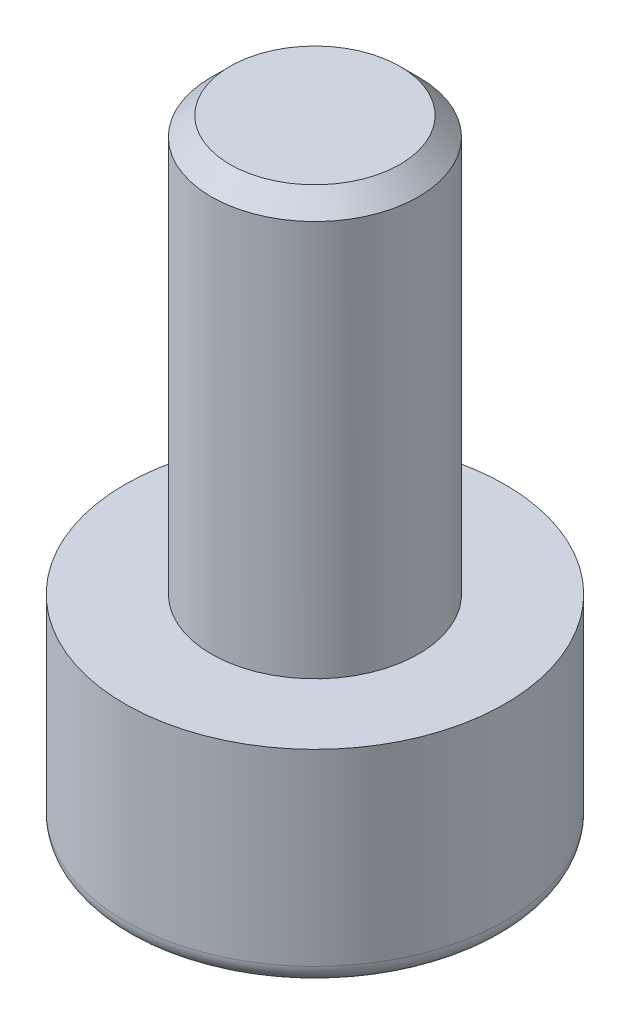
ISO-10303-21;
HEADER;
FILE_DESCRIPTION(('STEP AP214'),'2;1');
FILE_NAME('part.step','',(''),(''),'','','');
FILE_SCHEMA(('AUTOMOTIVE_DESIGN { 1 0 10303 214 1 1 1 1 }'));
ENDSEC;
DATA;
#1=APPLICATION_CONTEXT('core data for automotive mechanical design processes');
#2=APPLICATION_PROTOCOL_DEFINITION('international standard','automotive_design',2000,#1);
#3=PRODUCT_CONTEXT('',#1,'mechanical');
#4=PRODUCT('Part','Part','',(#3));
#5=PRODUCT_RELATED_PRODUCT_CATEGORY('part','',(#4));
#6=PRODUCT_DEFINITION_FORMATION('','',#4);
#7=PRODUCT_DEFINITION_CONTEXT('part definition',#1,'design');
#8=PRODUCT_DEFINITION('design','',#6,#7);
#9=PRODUCT_DEFINITION_SHAPE('','',#8);
#10=(LENGTH_UNIT() NAMED_UNIT(*) SI_UNIT(.MILLI.,.METRE.));
#11=(NAMED_UNIT(*) PLANE_ANGLE_UNIT() SI_UNIT($,.RADIAN.));
#12=(NAMED_UNIT(*) SI_UNIT($,.STERADIAN.) SOLID_ANGLE_UNIT());
#13=UNCERTAINTY_MEASURE_WITH_UNIT(LENGTH_MEASURE(1.E-05),#10,'distance_accuracy_value','');
#14=(GEOMETRIC_REPRESENTATION_CONTEXT(3) GLOBAL_UNCERTAINTY_ASSIGNED_CONTEXT((#13)) GLOBAL_UNIT_ASSIGNED_CONTEXT((#10,
#11,#12)) REPRESENTATION_CONTEXT('',''));
#15=CARTESIAN_POINT('',(0.,0.,0.));
#16=DIRECTION('',(0.,0.,1.));
#17=DIRECTION('',(1.,0.,0.));
#18=AXIS2_PLACEMENT_3D('',#15,#16,#17);
#19=CARTESIAN_POINT('',(0.,0.,0.));
#20=DIRECTION('',(0.,1.,0.));
#21=DIRECTION('',(-1.,0.,0.));
#22=AXIS2_PLACEMENT_3D('',#19,#20,#21);
#23=PLANE('',#22);
#24=CARTESIAN_POINT('',(0.,0.,0.));
#25=DIRECTION('',(0.,1.,0.));
#26=DIRECTION('',(-1.,0.,0.));
#27=AXIS2_PLACEMENT_3D('',#24,#25,#26);
#28=CIRCLE('',#27,2.47);
#29=CARTESIAN_POINT('',(-2.47,0.,0.));
#30=VERTEX_POINT('',#29);
#31=EDGE_CURVE('E150',#30,#30,#28,.F.);
#32=ORIENTED_EDGE('',*,*,#31,.T.);
#33=EDGE_LOOP('',(#32));
#34=FACE_BOUND('',#33,.T.);
#35=DIRECTION('',(-1.,0.,0.));
#36=VECTOR('',#35,1.);
#37=CARTESIAN_POINT('',(0.834271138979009,0.,1.445));
#38=LINE('',#37,#36);
#39=CARTESIAN_POINT('',(0.834271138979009,0.,1.445));
#40=VERTEX_POINT('',#39);
#41=CARTESIAN_POINT('',(-0.834271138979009,0.,1.445));
#42=VERTEX_POINT('',#41);
#43=EDGE_CURVE('E123',#40,#42,#38,.T.);
#44=ORIENTED_EDGE('',*,*,#43,.F.);
#45=DIRECTION('',(-0.5,0.,0.866025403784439));
#46=VECTOR('',#45,1.);
#47=CARTESIAN_POINT('',(1.66854227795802,0.,0.));
#48=LINE('',#47,#46);
#49=CARTESIAN_POINT('',(1.66854227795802,0.,0.));
#50=VERTEX_POINT('',#49);
#51=EDGE_CURVE('E49',#50,#40,#48,.T.);
#52=ORIENTED_EDGE('',*,*,#51,.F.);
#53=DIRECTION('',(0.5,0.,0.866025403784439));
#54=VECTOR('',#53,1.);
#55=CARTESIAN_POINT('',(0.83427113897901,0.,-1.445));
#56=LINE('',#55,#54);
#57=CARTESIAN_POINT('',(0.83427113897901,0.,-1.445));
#58=VERTEX_POINT('',#57);
#59=EDGE_CURVE('E132',#58,#50,#56,.T.);
#60=ORIENTED_EDGE('',*,*,#59,.F.);
#61=DIRECTION('',(1.,0.,0.));
#62=VECTOR('',#61,1.);
#63=CARTESIAN_POINT('',(-0.834271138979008,0.,-1.445));
#64=LINE('',#63,#62);
#65=CARTESIAN_POINT('',(-0.834271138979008,0.,-1.445));
#66=VERTEX_POINT('',#65);
#67=EDGE_CURVE('E130',#66,#58,#64,.T.);
#68=ORIENTED_EDGE('',*,*,#67,.F.);
#69=DIRECTION('',(0.5,0.,-0.866025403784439));
#70=VECTOR('',#69,1.);
#71=CARTESIAN_POINT('',(-1.66854227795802,0.,0.));
#72=LINE('',#71,#70);
#73=CARTESIAN_POINT('',(-1.66854227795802,0.,0.));
#74=VERTEX_POINT('',#73);
#75=EDGE_CURVE('E97',#74,#66,#72,.T.);
#76=ORIENTED_EDGE('',*,*,#75,.F.);
#77=DIRECTION('',(-0.5,0.,-0.866025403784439));
#78=VECTOR('',#77,1.);
#79=CARTESIAN_POINT('',(-0.834271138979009,0.,1.445));
#80=LINE('',#79,#78);
#81=EDGE_CURVE('E126',#42,#74,#80,.T.);
#82=ORIENTED_EDGE('',*,*,#81,.F.);
#83=EDGE_LOOP('',(#44,#52,#60,#68,#76,#82));
#84=FACE_BOUND('',#83,.T.);
#85=ADVANCED_FACE('F34',(#34,#84),#23,.F.);
#86=CARTESIAN_POINT('',(0.,9.,0.));
#87=DIRECTION('',(0.,1.,0.));
#88=DIRECTION('',(-1.,0.,0.));
#89=AXIS2_PLACEMENT_3D('',#86,#87,#88);
#90=CYLINDRICAL_SURFACE('',#89,2.75);
#91=CARTESIAN_POINT('',(0.,0.280000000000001,0.));
#92=DIRECTION('',(0.,1.,0.));
#93=DIRECTION('',(-1.,0.,0.));
#94=AXIS2_PLACEMENT_3D('',#91,#92,#93);
#95=CIRCLE('',#94,2.75);
#96=CARTESIAN_POINT('',(-2.75,0.280000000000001,0.));
#97=VERTEX_POINT('',#96);
#98=EDGE_CURVE('E147',#97,#97,#95,.T.);
#99=ORIENTED_EDGE('',*,*,#98,.T.);
#100=EDGE_LOOP('',(#99));
#101=FACE_BOUND('',#100,.T.);
#102=CARTESIAN_POINT('',(0.,3.,0.));
#103=DIRECTION('',(0.,1.,0.));
#104=DIRECTION('',(-1.,0.,0.));
#105=AXIS2_PLACEMENT_3D('',#102,#103,#104);
#106=CIRCLE('',#105,2.75);
#107=CARTESIAN_POINT('',(-2.75,3.,0.));
#108=VERTEX_POINT('',#107);
#109=EDGE_CURVE('E144',#108,#108,#106,.T.);
#110=ORIENTED_EDGE('',*,*,#109,.F.);
#111=EDGE_LOOP('',(#110));
#112=FACE_BOUND('',#111,.T.);
#113=ADVANCED_FACE('F166',(#101,#112),#90,.T.);
#114=CARTESIAN_POINT('',(2.75,3.,0.));
#115=DIRECTION('',(0.,-1.,0.));
#116=DIRECTION('',(1.,0.,0.));
#117=AXIS2_PLACEMENT_3D('',#114,#115,#116);
#118=PLANE('',#117);
#119=CARTESIAN_POINT('',(0.,3.,0.));
#120=DIRECTION('',(0.,1.,0.));
#121=DIRECTION('',(-1.,0.,0.));
#122=AXIS2_PLACEMENT_3D('',#119,#120,#121);
#123=CIRCLE('',#122,1.5);
#124=CARTESIAN_POINT('',(-1.5,3.,0.));
#125=VERTEX_POINT('',#124);
#126=EDGE_CURVE('E136',#125,#125,#123,.T.);
#127=ORIENTED_EDGE('',*,*,#126,.F.);
#128=EDGE_LOOP('',(#127));
#129=FACE_BOUND('',#128,.T.);
#130=ORIENTED_EDGE('',*,*,#109,.T.);
#131=EDGE_LOOP('',(#130));
#132=FACE_BOUND('',#131,.T.);
#133=ADVANCED_FACE('F172',(#129,#132),#118,.F.);
#134=CARTESIAN_POINT('',(0.,9.,0.));
#135=DIRECTION('',(0.,1.,0.));
#136=DIRECTION('',(-1.,0.,0.));
#137=AXIS2_PLACEMENT_3D('',#134,#135,#136);
#138=CYLINDRICAL_SURFACE('',#137,1.5);
#139=CARTESIAN_POINT('',(0.,8.73,0.));
#140=DIRECTION('',(0.,-1.,0.));
#141=DIRECTION('',(1.,0.,0.));
#142=AXIS2_PLACEMENT_3D('',#139,#140,#141);
#143=CIRCLE('',#142,1.5);
#144=CARTESIAN_POINT('',(1.5,8.73,0.));
#145=VERTEX_POINT('',#144);
#146=EDGE_CURVE('E11',#145,#145,#143,.T.);
#147=ORIENTED_EDGE('',*,*,#146,.T.);
#148=EDGE_LOOP('',(#147));
#149=FACE_BOUND('',#148,.T.);
#150=ORIENTED_EDGE('',*,*,#126,.T.);
#151=EDGE_LOOP('',(#150));
#152=FACE_BOUND('',#151,.T.);
#153=ADVANCED_FACE('F179',(#149,#152),#138,.T.);
#154=CARTESIAN_POINT('',(1.5,9.,0.));
#155=DIRECTION('',(0.,-1.,0.));
#156=DIRECTION('',(1.,0.,0.));
#157=AXIS2_PLACEMENT_3D('',#154,#155,#156);
#158=PLANE('',#157);
#159=CARTESIAN_POINT('',(0.,9.,0.));
#160=DIRECTION('',(0.,-1.,0.));
#161=DIRECTION('',(1.,0.,0.));
#162=AXIS2_PLACEMENT_3D('',#159,#160,#161);
#163=CIRCLE('',#162,1.23);
#164=CARTESIAN_POINT('',(1.23,9.,0.));
#165=VERTEX_POINT('',#164);
#166=EDGE_CURVE('E42',#165,#165,#163,.F.);
#167=ORIENTED_EDGE('',*,*,#166,.T.);
#168=EDGE_LOOP('',(#167));
#169=FACE_BOUND('',#168,.T.);
#170=ADVANCED_FACE('F155',(#169),#158,.F.);
#171=CARTESIAN_POINT('',(1.66854227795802,2.,0.));
#172=DIRECTION('',(0.866025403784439,0.,0.5));
#173=DIRECTION('',(0.5,0.,-0.866025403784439));
#174=AXIS2_PLACEMENT_3D('',#171,#172,#173);
#175=PLANE('',#174);
#176=ORIENTED_EDGE('',*,*,#51,.T.);
#177=DIRECTION('',(0.,-1.,0.));
#178=VECTOR('',#177,1.);
#179=CARTESIAN_POINT('',(0.834271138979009,2.,1.445));
#180=LINE('',#179,#178);
#181=CARTESIAN_POINT('',(0.834271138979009,2.,1.445));
#182=VERTEX_POINT('',#181);
#183=EDGE_CURVE('E79',#182,#40,#180,.T.);
#184=ORIENTED_EDGE('',*,*,#183,.F.);
#185=DIRECTION('',(-0.5,0.,0.866025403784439));
#186=VECTOR('',#185,1.);
#187=CARTESIAN_POINT('',(1.66854227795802,2.,0.));
#188=LINE('',#187,#186);
#189=CARTESIAN_POINT('',(1.66854227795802,2.,0.));
#190=VERTEX_POINT('',#189);
#191=EDGE_CURVE('E134',#190,#182,#188,.T.);
#192=ORIENTED_EDGE('',*,*,#191,.F.);
#193=DIRECTION('',(0.,-1.,0.));
#194=VECTOR('',#193,1.);
#195=CARTESIAN_POINT('',(1.66854227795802,2.,0.));
#196=LINE('',#195,#194);
#197=EDGE_CURVE('E57',#190,#50,#196,.T.);
#198=ORIENTED_EDGE('',*,*,#197,.T.);
#199=EDGE_LOOP('',(#176,#184,#192,#198));
#200=FACE_BOUND('',#199,.T.);
#201=ADVANCED_FACE('F186',(#200),#175,.F.);
#202=CARTESIAN_POINT('',(0.83427113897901,2.,-1.445));
#203=DIRECTION('',(0.866025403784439,0.,-0.5));
#204=DIRECTION('',(-0.5,0.,-0.866025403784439));
#205=AXIS2_PLACEMENT_3D('',#202,#203,#204);
#206=PLANE('',#205);
#207=ORIENTED_EDGE('',*,*,#59,.T.);
#208=ORIENTED_EDGE('',*,*,#197,.F.);
#209=DIRECTION('',(0.5,0.,0.866025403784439));
#210=VECTOR('',#209,1.);
#211=CARTESIAN_POINT('',(0.83427113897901,2.,-1.445));
#212=LINE('',#211,#210);
#213=CARTESIAN_POINT('',(0.83427113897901,2.,-1.445));
#214=VERTEX_POINT('',#213);
#215=EDGE_CURVE('E109',#214,#190,#212,.T.);
#216=ORIENTED_EDGE('',*,*,#215,.F.);
#217=DIRECTION('',(0.,-1.,0.));
#218=VECTOR('',#217,1.);
#219=CARTESIAN_POINT('',(0.83427113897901,2.,-1.445));
#220=LINE('',#219,#218);
#221=EDGE_CURVE('E101',#214,#58,#220,.T.);
#222=ORIENTED_EDGE('',*,*,#221,.T.);
#223=EDGE_LOOP('',(#207,#208,#216,#222));
#224=FACE_BOUND('',#223,.T.);
#225=ADVANCED_FACE('F189',(#224),#206,.F.);
#226=CARTESIAN_POINT('',(-0.834271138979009,2.,-1.445));
#227=DIRECTION('',(0.,0.,-1.));
#228=DIRECTION('',(-1.,0.,0.));
#229=AXIS2_PLACEMENT_3D('',#226,#227,#228);
#230=PLANE('',#229);
#231=ORIENTED_EDGE('',*,*,#67,.T.);
#232=ORIENTED_EDGE('',*,*,#221,.F.);
#233=DIRECTION('',(1.,0.,0.));
#234=VECTOR('',#233,1.);
#235=CARTESIAN_POINT('',(-0.834271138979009,2.,-1.445));
#236=LINE('',#235,#234);
#237=CARTESIAN_POINT('',(-0.834271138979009,2.,-1.445));
#238=VERTEX_POINT('',#237);
#239=EDGE_CURVE('E105',#238,#214,#236,.T.);
#240=ORIENTED_EDGE('',*,*,#239,.F.);
#241=DIRECTION('',(0.,-1.,0.));
#242=VECTOR('',#241,1.);
#243=CARTESIAN_POINT('',(-0.834271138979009,2.,-1.445));
#244=LINE('',#243,#242);
#245=EDGE_CURVE('E90',#238,#66,#244,.T.);
#246=ORIENTED_EDGE('',*,*,#245,.T.);
#247=EDGE_LOOP('',(#231,#232,#240,#246));
#248=FACE_BOUND('',#247,.T.);
#249=ADVANCED_FACE('F106',(#248),#230,.F.);
#250=CARTESIAN_POINT('',(-1.66854227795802,2.,0.));
#251=DIRECTION('',(-0.866025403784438,0.,-0.5));
#252=DIRECTION('',(-0.5,0.,0.866025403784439));
#253=AXIS2_PLACEMENT_3D('',#250,#251,#252);
#254=PLANE('',#253);
#255=ORIENTED_EDGE('',*,*,#75,.T.);
#256=ORIENTED_EDGE('',*,*,#245,.F.);
#257=DIRECTION('',(0.5,0.,-0.866025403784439));
#258=VECTOR('',#257,1.);
#259=CARTESIAN_POINT('',(-1.66854227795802,2.,0.));
#260=LINE('',#259,#258);
#261=CARTESIAN_POINT('',(-1.66854227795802,2.,0.));
#262=VERTEX_POINT('',#261);
#263=EDGE_CURVE('E94',#262,#238,#260,.T.);
#264=ORIENTED_EDGE('',*,*,#263,.F.);
#265=DIRECTION('',(0.,-1.,0.));
#266=VECTOR('',#265,1.);
#267=CARTESIAN_POINT('',(-1.66854227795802,2.,0.));
#268=LINE('',#267,#266);
#269=EDGE_CURVE('E102',#262,#74,#268,.T.);
#270=ORIENTED_EDGE('',*,*,#269,.T.);
#271=EDGE_LOOP('',(#255,#256,#264,#270));
#272=FACE_BOUND('',#271,.T.);
#273=ADVANCED_FACE('F92',(#272),#254,.F.);
#274=CARTESIAN_POINT('',(-0.834271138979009,2.,1.445));
#275=DIRECTION('',(-0.866025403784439,0.,0.5));
#276=DIRECTION('',(0.5,0.,0.866025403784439));
#277=AXIS2_PLACEMENT_3D('',#274,#275,#276);
#278=PLANE('',#277);
#279=ORIENTED_EDGE('',*,*,#81,.T.);
#280=ORIENTED_EDGE('',*,*,#269,.F.);
#281=DIRECTION('',(-0.5,0.,-0.866025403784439));
#282=VECTOR('',#281,1.);
#283=CARTESIAN_POINT('',(-0.834271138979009,2.,1.445));
#284=LINE('',#283,#282);
#285=CARTESIAN_POINT('',(-0.834271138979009,2.,1.445));
#286=VERTEX_POINT('',#285);
#287=EDGE_CURVE('E115',#286,#262,#284,.T.);
#288=ORIENTED_EDGE('',*,*,#287,.F.);
#289=DIRECTION('',(0.,-1.,0.));
#290=VECTOR('',#289,1.);
#291=CARTESIAN_POINT('',(-0.834271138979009,2.,1.445));
#292=LINE('',#291,#290);
#293=EDGE_CURVE('E139',#286,#42,#292,.T.);
#294=ORIENTED_EDGE('',*,*,#293,.T.);
#295=EDGE_LOOP('',(#279,#280,#288,#294));
#296=FACE_BOUND('',#295,.T.);
#297=ADVANCED_FACE('F193',(#296),#278,.F.);
#298=CARTESIAN_POINT('',(0.834271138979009,2.,1.445));
#299=DIRECTION('',(0.,0.,1.));
#300=DIRECTION('',(1.,0.,0.));
#301=AXIS2_PLACEMENT_3D('',#298,#299,#300);
#302=PLANE('',#301);
#303=ORIENTED_EDGE('',*,*,#43,.T.);
#304=ORIENTED_EDGE('',*,*,#293,.F.);
#305=DIRECTION('',(-1.,0.,0.));
#306=VECTOR('',#305,1.);
#307=CARTESIAN_POINT('',(0.834271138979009,2.,1.445));
#308=LINE('',#307,#306);
#309=EDGE_CURVE('E117',#182,#286,#308,.T.);
#310=ORIENTED_EDGE('',*,*,#309,.F.);
#311=ORIENTED_EDGE('',*,*,#183,.T.);
#312=EDGE_LOOP('',(#303,#304,#310,#311));
#313=FACE_BOUND('',#312,.T.);
#314=ADVANCED_FACE('F190',(#313),#302,.F.);
#315=CARTESIAN_POINT('',(0.,2.,0.));
#316=DIRECTION('',(0.,-1.,0.));
#317=DIRECTION('',(1.,0.,0.));
#318=AXIS2_PLACEMENT_3D('',#315,#316,#317);
#319=PLANE('',#318);
#320=ORIENTED_EDGE('',*,*,#191,.T.);
#321=ORIENTED_EDGE('',*,*,#309,.T.);
#322=ORIENTED_EDGE('',*,*,#287,.T.);
#323=ORIENTED_EDGE('',*,*,#263,.T.);
#324=ORIENTED_EDGE('',*,*,#239,.T.);
#325=ORIENTED_EDGE('',*,*,#215,.T.);
#326=EDGE_LOOP('',(#320,#321,#322,#323,#324,#325));
#327=FACE_BOUND('',#326,.T.);
#328=ADVANCED_FACE('F112',(#327),#319,.T.);
#329=CARTESIAN_POINT('',(0.,0.280000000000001,0.));
#330=DIRECTION('',(0.,1.,0.));
#331=DIRECTION('',(-1.,0.,0.));
#332=AXIS2_PLACEMENT_3D('',#329,#330,#331);
#333=TOROIDAL_SURFACE('',#332,2.47,0.28);
#334=ORIENTED_EDGE('',*,*,#31,.F.);
#335=EDGE_LOOP('',(#334));
#336=FACE_BOUND('',#335,.T.);
#337=ORIENTED_EDGE('',*,*,#98,.F.);
#338=EDGE_LOOP('',(#337));
#339=FACE_BOUND('',#338,.T.);
#340=ADVANCED_FACE('F158',(#336,#339),#333,.T.);
#341=CARTESIAN_POINT('',(0.,9.,0.));
#342=DIRECTION('',(0.,-1.,0.));
#343=DIRECTION('',(1.,0.,0.));
#344=AXIS2_PLACEMENT_3D('',#341,#342,#343);
#345=CONICAL_SURFACE('',#344,1.23,0.785398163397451);
#346=ORIENTED_EDGE('',*,*,#146,.F.);
#347=EDGE_LOOP('',(#346));
#348=FACE_BOUND('',#347,.T.);
#349=ORIENTED_EDGE('',*,*,#166,.F.);
#350=EDGE_LOOP('',(#349));
#351=FACE_BOUND('',#350,.T.);
#352=ADVANCED_FACE('F36',(#348,#351),#345,.T.);
#353=CLOSED_SHELL('',(#85,#113,#133,#153,#170,#201,#225,#249,#273,#297,#314,#328,#340,#352));
#354=MANIFOLD_SOLID_BREP('B2',#353);
#355=ADVANCED_BREP_SHAPE_REPRESENTATION('',(#18,#354),#14);
#356=SHAPE_DEFINITION_REPRESENTATION(#9,#355);
ENDSEC;
END-ISO-10303-21;
